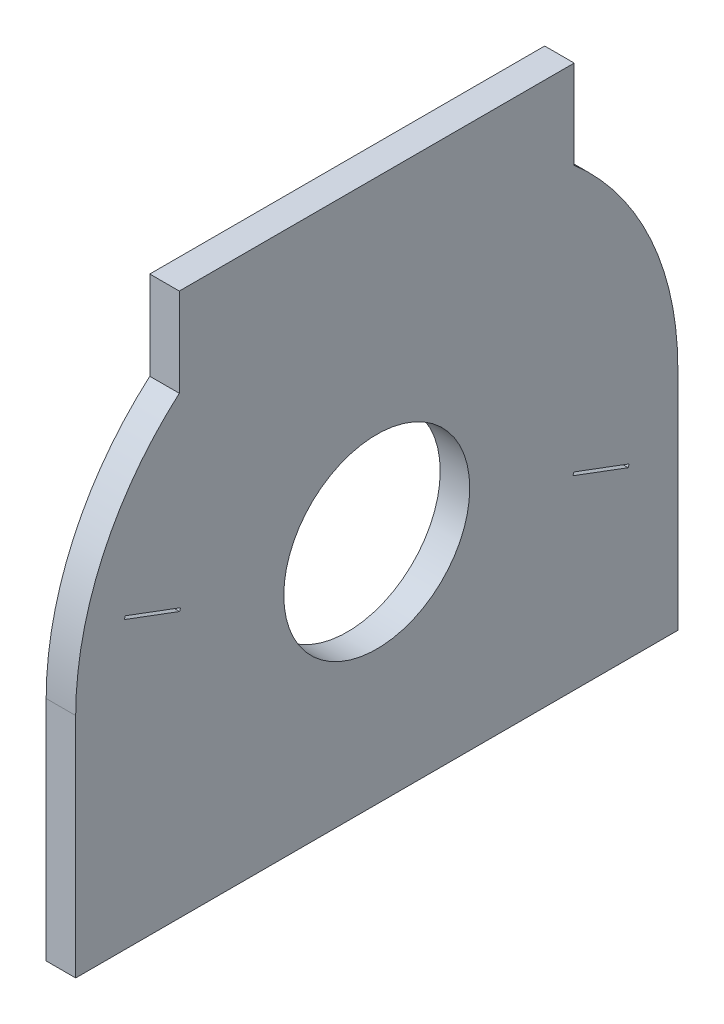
from build123d import *

# Parameters (mm, degrees)
SKETCH1_R           = 3.15
BOSS_EXTRUDE1_DEPTH = 1


with BuildPart() as part:
    # Sketch1 → Boss-Extrude1 (new body)
    with BuildSketch(Plane(origin=(-13.55, 0, 0), x_dir=(0, -1, 0), z_dir=(-1, 0, 0))):
        with BuildLine():
            Line((11.6, -10.2), (19.3, -10.2))
            Line((19.3, -10.2), (19.3, 10.2))
            Line((19.3, 10.2), (11.6, 10.2))
            ThreePointArc((11.6, 10.2), (7.368767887, 9.280984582), (3.9, 6.68954408))
            Line((3.9, 6.68954408), (0.9, 6.68954408))
            Line((0.9, 6.68954408), (0.9, -6.68954408))
            Line((0.9, -6.68954408), (3.9, -6.68954408))
            ThreePointArc((3.9, -6.68954408), (7.368767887, -9.280984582), (11.6, -10.2))
        make_face()
        with Locations(Location((11.6, 0, 0), (0, 0, 270))):
            Circle(SKETCH1_R, mode=Mode.SUBTRACT)
        Polygon((9.512959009, 8.51916182), (9.606626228, 8.554182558), (10.307040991, 6.68083818), (10.213373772, 6.645817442), align=None, mode=Mode.SUBTRACT)
        Polygon((12.892959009, -6.68083818), (12.986626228, -6.645817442), (13.687040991, -8.51916182), (13.593373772, -8.554182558), align=None, mode=Mode.SUBTRACT)
    extrude(amount=-BOSS_EXTRUDE1_DEPTH)


solid = part.part
